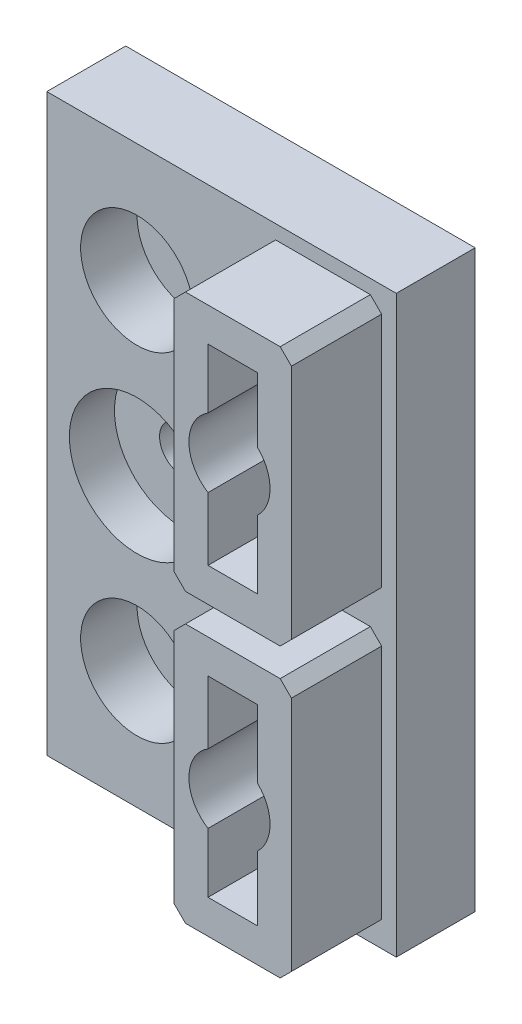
ISO-10303-21;
HEADER;
FILE_DESCRIPTION(('STEP AP214'),'2;1');
FILE_NAME('part.step','',(''),(''),'','','');
FILE_SCHEMA(('AUTOMOTIVE_DESIGN { 1 0 10303 214 1 1 1 1 }'));
ENDSEC;
DATA;
#1=APPLICATION_CONTEXT('core data for automotive mechanical design processes');
#2=APPLICATION_PROTOCOL_DEFINITION('international standard','automotive_design',2000,#1);
#3=PRODUCT_CONTEXT('',#1,'mechanical');
#4=PRODUCT('Part','Part','',(#3));
#5=PRODUCT_RELATED_PRODUCT_CATEGORY('part','',(#4));
#6=PRODUCT_DEFINITION_FORMATION('','',#4);
#7=PRODUCT_DEFINITION_CONTEXT('part definition',#1,'design');
#8=PRODUCT_DEFINITION('design','',#6,#7);
#9=PRODUCT_DEFINITION_SHAPE('','',#8);
#10=(LENGTH_UNIT() NAMED_UNIT(*) SI_UNIT(.MILLI.,.METRE.));
#11=(NAMED_UNIT(*) PLANE_ANGLE_UNIT() SI_UNIT($,.RADIAN.));
#12=(NAMED_UNIT(*) SI_UNIT($,.STERADIAN.) SOLID_ANGLE_UNIT());
#13=UNCERTAINTY_MEASURE_WITH_UNIT(LENGTH_MEASURE(1.E-05),#10,'distance_accuracy_value','');
#14=(GEOMETRIC_REPRESENTATION_CONTEXT(3) GLOBAL_UNCERTAINTY_ASSIGNED_CONTEXT((#13)) GLOBAL_UNIT_ASSIGNED_CONTEXT((#10,
#11,#12)) REPRESENTATION_CONTEXT('',''));
#15=CARTESIAN_POINT('',(0.,0.,0.));
#16=DIRECTION('',(0.,0.,1.));
#17=DIRECTION('',(1.,0.,0.));
#18=AXIS2_PLACEMENT_3D('',#15,#16,#17);
#19=CARTESIAN_POINT('',(0.,0.,5.));
#20=DIRECTION('',(0.,0.,1.));
#21=DIRECTION('',(1.,0.,0.));
#22=AXIS2_PLACEMENT_3D('',#19,#20,#21);
#23=PLANE('',#22);
#24=DIRECTION('',(-1.,0.,0.));
#25=VECTOR('',#24,1.);
#26=CARTESIAN_POINT('',(0.,-4.25000000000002,5.));
#27=LINE('',#26,#25);
#28=CARTESIAN_POINT('',(18.7,-4.25000000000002,5.));
#29=VERTEX_POINT('',#28);
#30=CARTESIAN_POINT('',(14.3000000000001,-4.25000000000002,5.));
#31=VERTEX_POINT('',#30);
#32=EDGE_CURVE('E335',#29,#31,#27,.T.);
#33=ORIENTED_EDGE('',*,*,#32,.T.);
#34=DIRECTION('',(0.,1.,0.));
#35=VECTOR('',#34,1.);
#36=CARTESIAN_POINT('',(14.3000000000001,0.,5.));
#37=LINE('',#36,#35);
#38=CARTESIAN_POINT('',(14.3000000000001,-9.84472001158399,5.));
#39=VERTEX_POINT('',#38);
#40=EDGE_CURVE('E334',#39,#31,#37,.T.);
#41=ORIENTED_EDGE('',*,*,#40,.F.);
#42=CARTESIAN_POINT('',(16.2040126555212,-12.9,5.));
#43=DIRECTION('',(0.,0.,1.));
#44=DIRECTION('',(1.,0.,0.));
#45=AXIS2_PLACEMENT_3D('',#42,#43,#44);
#46=CIRCLE('',#45,3.6);
#47=CARTESIAN_POINT('',(18.7,-10.3057665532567,5.));
#48=VERTEX_POINT('',#47);
#49=EDGE_CURVE('E522',#48,#39,#46,.T.);
#50=ORIENTED_EDGE('',*,*,#49,.F.);
#51=DIRECTION('',(0.,1.,0.));
#52=VECTOR('',#51,1.);
#53=CARTESIAN_POINT('',(18.7,0.,5.));
#54=LINE('',#53,#52);
#55=EDGE_CURVE('E330',#48,#29,#54,.T.);
#56=ORIENTED_EDGE('',*,*,#55,.T.);
#57=EDGE_LOOP('',(#33,#41,#50,#56));
#58=FACE_BOUND('',#57,.T.);
#59=ADVANCED_FACE('F39',(#58),#23,.T.);
#60=CARTESIAN_POINT('',(18.7,-21.2500000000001,5.));
#61=VERTEX_POINT('',#60);
#62=CARTESIAN_POINT('',(18.7,-15.4942334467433,5.));
#63=VERTEX_POINT('',#62);
#64=EDGE_CURVE('E277',#61,#63,#54,.T.);
#65=ORIENTED_EDGE('',*,*,#64,.T.);
#66=CARTESIAN_POINT('',(14.3000000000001,-15.955279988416,5.));
#67=VERTEX_POINT('',#66);
#68=EDGE_CURVE('E513',#67,#63,#46,.T.);
#69=ORIENTED_EDGE('',*,*,#68,.F.);
#70=CARTESIAN_POINT('',(14.3000000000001,-21.2500000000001,5.));
#71=VERTEX_POINT('',#70);
#72=EDGE_CURVE('E332',#71,#67,#37,.T.);
#73=ORIENTED_EDGE('',*,*,#72,.F.);
#74=DIRECTION('',(-1.,0.,0.));
#75=VECTOR('',#74,1.);
#76=CARTESIAN_POINT('',(0.,-21.2500000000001,5.));
#77=LINE('',#76,#75);
#78=EDGE_CURVE('E329',#61,#71,#77,.T.);
#79=ORIENTED_EDGE('',*,*,#78,.F.);
#80=EDGE_LOOP('',(#65,#69,#73,#79));
#81=FACE_BOUND('',#80,.T.);
#82=ADVANCED_FACE('F645',(#81),#23,.T.);
#83=CARTESIAN_POINT('',(16.2040126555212,12.9,5.));
#84=DIRECTION('',(0.,0.,1.));
#85=DIRECTION('',(1.,0.,0.));
#86=AXIS2_PLACEMENT_3D('',#83,#84,#85);
#87=CIRCLE('',#86,3.6);
#88=CARTESIAN_POINT('',(18.7000000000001,15.4942334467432,5.));
#89=VERTEX_POINT('',#88);
#90=CARTESIAN_POINT('',(14.3000000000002,15.955279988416,5.));
#91=VERTEX_POINT('',#90);
#92=EDGE_CURVE('E530',#89,#91,#87,.T.);
#93=ORIENTED_EDGE('',*,*,#92,.F.);
#94=DIRECTION('',(0.,1.,0.));
#95=VECTOR('',#94,1.);
#96=CARTESIAN_POINT('',(18.7000000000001,0.,5.));
#97=LINE('',#96,#95);
#98=CARTESIAN_POINT('',(18.7000000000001,21.25,5.));
#99=VERTEX_POINT('',#98);
#100=EDGE_CURVE('E395',#89,#99,#97,.T.);
#101=ORIENTED_EDGE('',*,*,#100,.T.);
#102=DIRECTION('',(-1.,0.,0.));
#103=VECTOR('',#102,1.);
#104=CARTESIAN_POINT('',(0.,21.25,5.));
#105=LINE('',#104,#103);
#106=CARTESIAN_POINT('',(14.3000000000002,21.25,5.));
#107=VERTEX_POINT('',#106);
#108=EDGE_CURVE('E557',#99,#107,#105,.T.);
#109=ORIENTED_EDGE('',*,*,#108,.T.);
#110=DIRECTION('',(0.,1.,0.));
#111=VECTOR('',#110,1.);
#112=CARTESIAN_POINT('',(14.3000000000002,0.,5.));
#113=LINE('',#112,#111);
#114=EDGE_CURVE('E560',#91,#107,#113,.T.);
#115=ORIENTED_EDGE('',*,*,#114,.F.);
#116=EDGE_LOOP('',(#93,#101,#109,#115));
#117=FACE_BOUND('',#116,.T.);
#118=ADVANCED_FACE('F648',(#117),#23,.T.);
#119=DIRECTION('',(-1.,0.,0.));
#120=VECTOR('',#119,1.);
#121=CARTESIAN_POINT('',(0.,4.24999999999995,5.));
#122=LINE('',#121,#120);
#123=CARTESIAN_POINT('',(18.7000000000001,4.24999999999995,5.));
#124=VERTEX_POINT('',#123);
#125=CARTESIAN_POINT('',(14.3000000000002,4.24999999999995,5.));
#126=VERTEX_POINT('',#125);
#127=EDGE_CURVE('E391',#124,#126,#122,.T.);
#128=ORIENTED_EDGE('',*,*,#127,.F.);
#129=CARTESIAN_POINT('',(18.7000000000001,10.3057665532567,5.));
#130=VERTEX_POINT('',#129);
#131=EDGE_CURVE('E280',#124,#130,#97,.T.);
#132=ORIENTED_EDGE('',*,*,#131,.T.);
#133=CARTESIAN_POINT('',(14.3000000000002,9.84472001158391,5.));
#134=VERTEX_POINT('',#133);
#135=EDGE_CURVE('E401',#134,#130,#87,.T.);
#136=ORIENTED_EDGE('',*,*,#135,.F.);
#137=EDGE_CURVE('E563',#126,#134,#113,.T.);
#138=ORIENTED_EDGE('',*,*,#137,.F.);
#139=EDGE_LOOP('',(#128,#132,#136,#138));
#140=FACE_BOUND('',#139,.T.);
#141=ADVANCED_FACE('F653',(#140),#23,.T.);
#142=DIRECTION('',(-1.,0.,0.));
#143=VECTOR('',#142,1.);
#144=CARTESIAN_POINT('',(0.,-24.2500000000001,5.));
#145=LINE('',#144,#143);
#146=CARTESIAN_POINT('',(20.7,-24.2500000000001,5.));
#147=VERTEX_POINT('',#146);
#148=CARTESIAN_POINT('',(12.3000000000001,-24.2500000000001,5.));
#149=VERTEX_POINT('',#148);
#150=EDGE_CURVE('E341',#147,#149,#145,.T.);
#151=ORIENTED_EDGE('',*,*,#150,.T.);
#152=DIRECTION('',(0.707106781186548,-0.707106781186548,0.));
#153=VECTOR('',#152,1.);
#154=CARTESIAN_POINT('',(12.3000000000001,-24.2500000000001,5.));
#155=LINE('',#154,#153);
#156=CARTESIAN_POINT('',(11.3000000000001,-23.2500000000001,5.));
#157=VERTEX_POINT('',#156);
#158=EDGE_CURVE('E592',#149,#157,#155,.F.);
#159=ORIENTED_EDGE('',*,*,#158,.T.);
#160=DIRECTION('',(0.,1.,0.));
#161=VECTOR('',#160,1.);
#162=CARTESIAN_POINT('',(11.3000000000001,0.,5.));
#163=LINE('',#162,#161);
#164=CARTESIAN_POINT('',(11.3000000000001,-2.25000000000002,5.));
#165=VERTEX_POINT('',#164);
#166=EDGE_CURVE('E338',#157,#165,#163,.T.);
#167=ORIENTED_EDGE('',*,*,#166,.T.);
#168=DIRECTION('',(0.70710678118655,0.707106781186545,0.));
#169=VECTOR('',#168,1.);
#170=CARTESIAN_POINT('',(11.3000000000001,-2.25000000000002,5.));
#171=LINE('',#170,#169);
#172=CARTESIAN_POINT('',(12.3000000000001,-1.25000000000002,5.));
#173=VERTEX_POINT('',#172);
#174=EDGE_CURVE('E594',#165,#173,#171,.T.);
#175=ORIENTED_EDGE('',*,*,#174,.T.);
#176=DIRECTION('',(-1.,0.,0.));
#177=VECTOR('',#176,1.);
#178=CARTESIAN_POINT('',(0.,-1.25000000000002,5.));
#179=LINE('',#178,#177);
#180=CARTESIAN_POINT('',(20.7,-1.25000000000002,5.));
#181=VERTEX_POINT('',#180);
#182=EDGE_CURVE('E297',#181,#173,#179,.T.);
#183=ORIENTED_EDGE('',*,*,#182,.F.);
#184=DIRECTION('',(-0.707106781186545,0.70710678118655,0.));
#185=VECTOR('',#184,1.);
#186=CARTESIAN_POINT('',(20.7,-1.25000000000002,5.));
#187=LINE('',#186,#185);
#188=CARTESIAN_POINT('',(21.7,-2.25000000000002,5.));
#189=VERTEX_POINT('',#188);
#190=EDGE_CURVE('E596',#181,#189,#187,.F.);
#191=ORIENTED_EDGE('',*,*,#190,.T.);
#192=DIRECTION('',(0.,1.,0.));
#193=VECTOR('',#192,1.);
#194=CARTESIAN_POINT('',(21.7,0.,5.));
#195=LINE('',#194,#193);
#196=CARTESIAN_POINT('',(21.7,-23.2500000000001,5.));
#197=VERTEX_POINT('',#196);
#198=EDGE_CURVE('E301',#197,#189,#195,.T.);
#199=ORIENTED_EDGE('',*,*,#198,.F.);
#200=DIRECTION('',(-0.70710678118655,-0.707106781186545,0.));
#201=VECTOR('',#200,1.);
#202=CARTESIAN_POINT('',(21.7,-23.2500000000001,5.));
#203=LINE('',#202,#201);
#204=EDGE_CURVE('E585',#197,#147,#203,.T.);
#205=ORIENTED_EDGE('',*,*,#204,.T.);
#206=EDGE_LOOP('',(#151,#159,#167,#175,#183,#191,#199,#205));
#207=FACE_BOUND('',#206,.T.);
#208=CARTESIAN_POINT('',(0.,0.,5.));
#209=DIRECTION('',(0.,0.,1.));
#210=DIRECTION('',(1.,0.,0.));
#211=AXIS2_PLACEMENT_3D('',#208,#209,#210);
#212=CIRCLE('',#211,6.);
#213=CARTESIAN_POINT('',(6.,0.,5.));
#214=VERTEX_POINT('',#213);
#215=EDGE_CURVE('E492',#214,#214,#212,.T.);
#216=ORIENTED_EDGE('',*,*,#215,.F.);
#217=EDGE_LOOP('',(#216));
#218=FACE_BOUND('',#217,.T.);
#219=CARTESIAN_POINT('',(0.,-15.,5.));
#220=DIRECTION('',(0.,0.,1.));
#221=DIRECTION('',(1.,0.,0.));
#222=AXIS2_PLACEMENT_3D('',#219,#220,#221);
#223=CIRCLE('',#222,5.);
#224=CARTESIAN_POINT('',(5.,-15.,5.));
#225=VERTEX_POINT('',#224);
#226=EDGE_CURVE('E503',#225,#225,#223,.T.);
#227=ORIENTED_EDGE('',*,*,#226,.F.);
#228=EDGE_LOOP('',(#227));
#229=FACE_BOUND('',#228,.T.);
#230=CARTESIAN_POINT('',(0.,15.,5.));
#231=DIRECTION('',(0.,0.,1.));
#232=DIRECTION('',(1.,0.,0.));
#233=AXIS2_PLACEMENT_3D('',#230,#231,#232);
#234=CIRCLE('',#233,5.);
#235=CARTESIAN_POINT('',(5.00000000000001,15.,5.));
#236=VERTEX_POINT('',#235);
#237=EDGE_CURVE('E506',#236,#236,#234,.T.);
#238=ORIENTED_EDGE('',*,*,#237,.F.);
#239=EDGE_LOOP('',(#238));
#240=FACE_BOUND('',#239,.T.);
#241=DIRECTION('',(0.,-1.,0.));
#242=VECTOR('',#241,1.);
#243=CARTESIAN_POINT('',(23.,0.,5.));
#244=LINE('',#243,#242);
#245=CARTESIAN_POINT('',(23.,25.5,5.));
#246=VERTEX_POINT('',#245);
#247=CARTESIAN_POINT('',(23.,-25.5,5.));
#248=VERTEX_POINT('',#247);
#249=EDGE_CURVE('E439',#246,#248,#244,.T.);
#250=ORIENTED_EDGE('',*,*,#249,.F.);
#251=DIRECTION('',(1.,0.,0.));
#252=VECTOR('',#251,1.);
#253=CARTESIAN_POINT('',(0.,25.5,5.));
#254=LINE('',#253,#252);
#255=CARTESIAN_POINT('',(-7.99999999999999,25.5,5.));
#256=VERTEX_POINT('',#255);
#257=EDGE_CURVE('E435',#256,#246,#254,.T.);
#258=ORIENTED_EDGE('',*,*,#257,.F.);
#259=DIRECTION('',(0.,-1.,0.));
#260=VECTOR('',#259,1.);
#261=CARTESIAN_POINT('',(-7.99999999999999,0.,5.));
#262=LINE('',#261,#260);
#263=CARTESIAN_POINT('',(-7.99999999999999,-25.5,5.));
#264=VERTEX_POINT('',#263);
#265=EDGE_CURVE('E510',#256,#264,#262,.T.);
#266=ORIENTED_EDGE('',*,*,#265,.T.);
#267=DIRECTION('',(1.,0.,0.));
#268=VECTOR('',#267,1.);
#269=CARTESIAN_POINT('',(0.,-25.5,5.));
#270=LINE('',#269,#268);
#271=EDGE_CURVE('E446',#264,#248,#270,.T.);
#272=ORIENTED_EDGE('',*,*,#271,.T.);
#273=EDGE_LOOP('',(#250,#258,#266,#272));
#274=FACE_BOUND('',#273,.T.);
#275=CARTESIAN_POINT('',(10.,0.,5.));
#276=DIRECTION('',(0.,0.,1.));
#277=DIRECTION('',(1.,0.,0.));
#278=AXIS2_PLACEMENT_3D('',#275,#276,#277);
#279=CIRCLE('',#278,1.);
#280=CARTESIAN_POINT('',(11.,0.,5.));
#281=VERTEX_POINT('',#280);
#282=EDGE_CURVE('E458',#281,#281,#279,.T.);
#283=ORIENTED_EDGE('',*,*,#282,.F.);
#284=EDGE_LOOP('',(#283));
#285=FACE_BOUND('',#284,.T.);
#286=DIRECTION('',(0.,1.,0.));
#287=VECTOR('',#286,1.);
#288=CARTESIAN_POINT('',(21.7000000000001,0.,5.));
#289=LINE('',#288,#287);
#290=CARTESIAN_POINT('',(21.7000000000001,2.24999999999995,5.));
#291=VERTEX_POINT('',#290);
#292=CARTESIAN_POINT('',(21.7000000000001,23.25,5.));
#293=VERTEX_POINT('',#292);
#294=EDGE_CURVE('E567',#291,#293,#289,.T.);
#295=ORIENTED_EDGE('',*,*,#294,.F.);
#296=DIRECTION('',(-0.707106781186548,-0.707106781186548,0.));
#297=VECTOR('',#296,1.);
#298=CARTESIAN_POINT('',(21.7000000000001,2.24999999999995,5.));
#299=LINE('',#298,#297);
#300=CARTESIAN_POINT('',(20.7000000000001,1.24999999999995,5.));
#301=VERTEX_POINT('',#300);
#302=EDGE_CURVE('E600',#291,#301,#299,.T.);
#303=ORIENTED_EDGE('',*,*,#302,.T.);
#304=DIRECTION('',(-1.,0.,0.));
#305=VECTOR('',#304,1.);
#306=CARTESIAN_POINT('',(0.,1.24999999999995,5.));
#307=LINE('',#306,#305);
#308=CARTESIAN_POINT('',(12.3000000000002,1.24999999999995,5.));
#309=VERTEX_POINT('',#308);
#310=EDGE_CURVE('E558',#301,#309,#307,.T.);
#311=ORIENTED_EDGE('',*,*,#310,.T.);
#312=DIRECTION('',(0.707106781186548,-0.707106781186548,0.));
#313=VECTOR('',#312,1.);
#314=CARTESIAN_POINT('',(12.3000000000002,1.24999999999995,5.));
#315=LINE('',#314,#313);
#316=CARTESIAN_POINT('',(11.3000000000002,2.24999999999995,5.));
#317=VERTEX_POINT('',#316);
#318=EDGE_CURVE('E598',#309,#317,#315,.F.);
#319=ORIENTED_EDGE('',*,*,#318,.T.);
#320=DIRECTION('',(0.,1.,0.));
#321=VECTOR('',#320,1.);
#322=CARTESIAN_POINT('',(11.3000000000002,0.,5.));
#323=LINE('',#322,#321);
#324=CARTESIAN_POINT('',(11.3000000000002,23.25,5.));
#325=VERTEX_POINT('',#324);
#326=EDGE_CURVE('E556',#317,#325,#323,.T.);
#327=ORIENTED_EDGE('',*,*,#326,.T.);
#328=DIRECTION('',(0.707106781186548,0.707106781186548,0.));
#329=VECTOR('',#328,1.);
#330=CARTESIAN_POINT('',(11.3000000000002,23.25,5.));
#331=LINE('',#330,#329);
#332=CARTESIAN_POINT('',(12.3000000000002,24.25,5.));
#333=VERTEX_POINT('',#332);
#334=EDGE_CURVE('E12',#325,#333,#331,.T.);
#335=ORIENTED_EDGE('',*,*,#334,.T.);
#336=DIRECTION('',(-1.,0.,0.));
#337=VECTOR('',#336,1.);
#338=CARTESIAN_POINT('',(0.,24.25,5.));
#339=LINE('',#338,#337);
#340=CARTESIAN_POINT('',(20.7000000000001,24.25,5.));
#341=VERTEX_POINT('',#340);
#342=EDGE_CURVE('E364',#341,#333,#339,.T.);
#343=ORIENTED_EDGE('',*,*,#342,.F.);
#344=DIRECTION('',(-0.707106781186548,0.707106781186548,0.));
#345=VECTOR('',#344,1.);
#346=CARTESIAN_POINT('',(20.7000000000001,24.25,5.));
#347=LINE('',#346,#345);
#348=EDGE_CURVE('E47',#341,#293,#347,.F.);
#349=ORIENTED_EDGE('',*,*,#348,.T.);
#350=EDGE_LOOP('',(#295,#303,#311,#319,#327,#335,#343,#349));
#351=FACE_BOUND('',#350,.T.);
#352=ADVANCED_FACE('F601',(#207,#218,#229,#240,#274,#285,#351),#23,.T.);
#353=CARTESIAN_POINT('',(16.2040126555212,-12.9,-12.1823376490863));
#354=DIRECTION('',(0.,0.,1.));
#355=DIRECTION('',(1.,0.,0.));
#356=AXIS2_PLACEMENT_3D('',#353,#354,#355);
#357=CYLINDRICAL_SURFACE('',#356,3.6);
#358=CARTESIAN_POINT('',(16.2040126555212,-12.9,1.5));
#359=DIRECTION('',(0.,0.,-1.));
#360=DIRECTION('',(-1.,0.,0.));
#361=AXIS2_PLACEMENT_3D('',#358,#359,#360);
#362=CIRCLE('',#361,3.6);
#363=CARTESIAN_POINT('',(12.6040126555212,-12.9,1.5));
#364=VERTEX_POINT('',#363);
#365=EDGE_CURVE('E477',#364,#364,#362,.F.);
#366=ORIENTED_EDGE('',*,*,#365,.F.);
#367=EDGE_LOOP('',(#366));
#368=FACE_BOUND('',#367,.T.);
#369=ORIENTED_EDGE('',*,*,#49,.T.);
#370=DIRECTION('',(0.,0.,-1.));
#371=VECTOR('',#370,1.);
#372=CARTESIAN_POINT('',(14.3000000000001,-9.84472001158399,13.));
#373=LINE('',#372,#371);
#374=CARTESIAN_POINT('',(14.3000000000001,-9.84472001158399,13.));
#375=VERTEX_POINT('',#374);
#376=EDGE_CURVE('E354',#375,#39,#373,.T.);
#377=ORIENTED_EDGE('',*,*,#376,.F.);
#378=CARTESIAN_POINT('',(16.2040126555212,-12.9,13.));
#379=DIRECTION('',(0.,0.,1.));
#380=DIRECTION('',(1.,0.,0.));
#381=AXIS2_PLACEMENT_3D('',#378,#379,#380);
#382=CIRCLE('',#381,3.6);
#383=CARTESIAN_POINT('',(14.3000000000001,-15.955279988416,13.));
#384=VERTEX_POINT('',#383);
#385=EDGE_CURVE('E308',#384,#375,#382,.F.);
#386=ORIENTED_EDGE('',*,*,#385,.F.);
#387=DIRECTION('',(0.,0.,-1.));
#388=VECTOR('',#387,1.);
#389=CARTESIAN_POINT('',(14.3000000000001,-15.955279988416,13.));
#390=LINE('',#389,#388);
#391=EDGE_CURVE('E356',#384,#67,#390,.T.);
#392=ORIENTED_EDGE('',*,*,#391,.T.);
#393=ORIENTED_EDGE('',*,*,#68,.T.);
#394=DIRECTION('',(0.,0.,-1.));
#395=VECTOR('',#394,1.);
#396=CARTESIAN_POINT('',(18.7,-15.4942334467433,13.));
#397=LINE('',#396,#395);
#398=CARTESIAN_POINT('',(18.7,-15.4942334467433,13.));
#399=VERTEX_POINT('',#398);
#400=EDGE_CURVE('E327',#399,#63,#397,.T.);
#401=ORIENTED_EDGE('',*,*,#400,.F.);
#402=CARTESIAN_POINT('',(18.7,-10.3057665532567,13.));
#403=VERTEX_POINT('',#402);
#404=EDGE_CURVE('E295',#403,#399,#382,.F.);
#405=ORIENTED_EDGE('',*,*,#404,.F.);
#406=DIRECTION('',(0.,0.,-1.));
#407=VECTOR('',#406,1.);
#408=CARTESIAN_POINT('',(18.7,-10.3057665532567,13.));
#409=LINE('',#408,#407);
#410=EDGE_CURVE('E347',#403,#48,#409,.T.);
#411=ORIENTED_EDGE('',*,*,#410,.T.);
#412=EDGE_LOOP('',(#369,#377,#386,#392,#393,#401,#405,#411));
#413=FACE_BOUND('',#412,.T.);
#414=ADVANCED_FACE('F661',(#368,#413),#357,.F.);
#415=CARTESIAN_POINT('',(16.2040126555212,12.9,-12.1823376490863));
#416=DIRECTION('',(0.,0.,1.));
#417=DIRECTION('',(1.,0.,0.));
#418=AXIS2_PLACEMENT_3D('',#415,#416,#417);
#419=CYLINDRICAL_SURFACE('',#418,3.6);
#420=CARTESIAN_POINT('',(16.2040126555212,12.9,1.5));
#421=DIRECTION('',(0.,0.,-1.));
#422=DIRECTION('',(-1.,0.,0.));
#423=AXIS2_PLACEMENT_3D('',#420,#421,#422);
#424=CIRCLE('',#423,3.6);
#425=CARTESIAN_POINT('',(12.6040126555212,12.9,1.5));
#426=VERTEX_POINT('',#425);
#427=EDGE_CURVE('E474',#426,#426,#424,.F.);
#428=ORIENTED_EDGE('',*,*,#427,.F.);
#429=EDGE_LOOP('',(#428));
#430=FACE_BOUND('',#429,.T.);
#431=ORIENTED_EDGE('',*,*,#92,.T.);
#432=DIRECTION('',(0.,0.,-1.));
#433=VECTOR('',#432,1.);
#434=CARTESIAN_POINT('',(14.3000000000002,15.955279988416,13.));
#435=LINE('',#434,#433);
#436=CARTESIAN_POINT('',(14.3000000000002,15.955279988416,13.));
#437=VERTEX_POINT('',#436);
#438=EDGE_CURVE('E422',#437,#91,#435,.T.);
#439=ORIENTED_EDGE('',*,*,#438,.F.);
#440=CARTESIAN_POINT('',(16.2040126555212,12.9,13.));
#441=DIRECTION('',(0.,0.,1.));
#442=DIRECTION('',(1.,0.,0.));
#443=AXIS2_PLACEMENT_3D('',#440,#441,#442);
#444=CIRCLE('',#443,3.6);
#445=CARTESIAN_POINT('',(14.3000000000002,9.84472001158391,13.));
#446=VERTEX_POINT('',#445);
#447=EDGE_CURVE('E369',#446,#437,#444,.F.);
#448=ORIENTED_EDGE('',*,*,#447,.F.);
#449=DIRECTION('',(0.,0.,-1.));
#450=VECTOR('',#449,1.);
#451=CARTESIAN_POINT('',(14.3000000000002,9.84472001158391,13.));
#452=LINE('',#451,#450);
#453=EDGE_CURVE('E431',#446,#134,#452,.T.);
#454=ORIENTED_EDGE('',*,*,#453,.T.);
#455=ORIENTED_EDGE('',*,*,#135,.T.);
#456=DIRECTION('',(0.,0.,-1.));
#457=VECTOR('',#456,1.);
#458=CARTESIAN_POINT('',(18.7000000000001,10.3057665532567,13.));
#459=LINE('',#458,#457);
#460=CARTESIAN_POINT('',(18.7000000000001,10.3057665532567,13.));
#461=VERTEX_POINT('',#460);
#462=EDGE_CURVE('E388',#461,#130,#459,.T.);
#463=ORIENTED_EDGE('',*,*,#462,.F.);
#464=CARTESIAN_POINT('',(18.7000000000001,15.4942334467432,13.));
#465=VERTEX_POINT('',#464);
#466=EDGE_CURVE('E372',#465,#461,#444,.F.);
#467=ORIENTED_EDGE('',*,*,#466,.F.);
#468=DIRECTION('',(0.,0.,-1.));
#469=VECTOR('',#468,1.);
#470=CARTESIAN_POINT('',(18.7000000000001,15.4942334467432,13.));
#471=LINE('',#470,#469);
#472=EDGE_CURVE('E405',#465,#89,#471,.T.);
#473=ORIENTED_EDGE('',*,*,#472,.T.);
#474=EDGE_LOOP('',(#431,#439,#448,#454,#455,#463,#467,#473));
#475=FACE_BOUND('',#474,.T.);
#476=ADVANCED_FACE('F538',(#430,#475),#419,.F.);
#477=CARTESIAN_POINT('',(-7.99999999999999,0.,5.));
#478=DIRECTION('',(1.,0.,0.));
#479=DIRECTION('',(0.,0.,-1.));
#480=AXIS2_PLACEMENT_3D('',#477,#478,#479);
#481=PLANE('',#480);
#482=DIRECTION('',(0.,0.,1.));
#483=VECTOR('',#482,1.);
#484=CARTESIAN_POINT('',(-7.99999999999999,-25.5,-5.));
#485=LINE('',#484,#483);
#486=CARTESIAN_POINT('',(-7.99999999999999,-25.5,-2.));
#487=VERTEX_POINT('',#486);
#488=EDGE_CURVE('E456',#487,#264,#485,.T.);
#489=ORIENTED_EDGE('',*,*,#488,.T.);
#490=ORIENTED_EDGE('',*,*,#265,.F.);
#491=DIRECTION('',(0.,0.,1.));
#492=VECTOR('',#491,1.);
#493=CARTESIAN_POINT('',(-7.99999999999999,25.5,-61.6824932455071));
#494=LINE('',#493,#492);
#495=CARTESIAN_POINT('',(-7.99999999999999,25.5,-2.));
#496=VERTEX_POINT('',#495);
#497=EDGE_CURVE('E438',#496,#256,#494,.T.);
#498=ORIENTED_EDGE('',*,*,#497,.F.);
#499=DIRECTION('',(0.,1.,0.));
#500=VECTOR('',#499,1.);
#501=CARTESIAN_POINT('',(-7.99999999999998,25.8,-2.));
#502=LINE('',#501,#500);
#503=EDGE_CURVE('E499',#487,#496,#502,.T.);
#504=ORIENTED_EDGE('',*,*,#503,.F.);
#505=EDGE_LOOP('',(#489,#490,#498,#504));
#506=FACE_BOUND('',#505,.T.);
#507=ADVANCED_FACE('F705',(#506),#481,.F.);
#508=CARTESIAN_POINT('',(0.,0.,-2.));
#509=DIRECTION('',(0.,0.,-1.));
#510=DIRECTION('',(-1.,0.,0.));
#511=AXIS2_PLACEMENT_3D('',#508,#509,#510);
#512=PLANE('',#511);
#513=DIRECTION('',(-1.,0.,0.));
#514=VECTOR('',#513,1.);
#515=CARTESIAN_POINT('',(0.,-25.5,-2.));
#516=LINE('',#515,#514);
#517=CARTESIAN_POINT('',(23.,-25.5,-2.));
#518=VERTEX_POINT('',#517);
#519=EDGE_CURVE('E527',#518,#487,#516,.T.);
#520=ORIENTED_EDGE('',*,*,#519,.T.);
#521=ORIENTED_EDGE('',*,*,#503,.T.);
#522=DIRECTION('',(1.,0.,0.));
#523=VECTOR('',#522,1.);
#524=CARTESIAN_POINT('',(0.,25.5,-2.));
#525=LINE('',#524,#523);
#526=CARTESIAN_POINT('',(23.,25.5,-2.));
#527=VERTEX_POINT('',#526);
#528=EDGE_CURVE('E443',#496,#527,#525,.T.);
#529=ORIENTED_EDGE('',*,*,#528,.T.);
#530=DIRECTION('',(0.,-1.,0.));
#531=VECTOR('',#530,1.);
#532=CARTESIAN_POINT('',(23.,0.,-2.));
#533=LINE('',#532,#531);
#534=EDGE_CURVE('E442',#527,#518,#533,.T.);
#535=ORIENTED_EDGE('',*,*,#534,.T.);
#536=EDGE_LOOP('',(#520,#521,#529,#535));
#537=FACE_BOUND('',#536,.T.);
#538=CARTESIAN_POINT('',(10.,0.,-2.));
#539=DIRECTION('',(0.,0.,-1.));
#540=DIRECTION('',(-1.,0.,0.));
#541=AXIS2_PLACEMENT_3D('',#538,#539,#540);
#542=CIRCLE('',#541,1.);
#543=CARTESIAN_POINT('',(9.,0.,-2.));
#544=VERTEX_POINT('',#543);
#545=EDGE_CURVE('E461',#544,#544,#542,.T.);
#546=ORIENTED_EDGE('',*,*,#545,.F.);
#547=EDGE_LOOP('',(#546));
#548=FACE_BOUND('',#547,.T.);
#549=CARTESIAN_POINT('',(16.2040126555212,-12.9,-2.));
#550=DIRECTION('',(0.,0.,-1.));
#551=DIRECTION('',(-1.,0.,0.));
#552=AXIS2_PLACEMENT_3D('',#549,#550,#551);
#553=CIRCLE('',#552,1.);
#554=CARTESIAN_POINT('',(15.2040126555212,-12.9,-2.));
#555=VERTEX_POINT('',#554);
#556=EDGE_CURVE('E465',#555,#555,#553,.T.);
#557=ORIENTED_EDGE('',*,*,#556,.F.);
#558=EDGE_LOOP('',(#557));
#559=FACE_BOUND('',#558,.T.);
#560=CARTESIAN_POINT('',(16.2040126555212,12.9,-2.));
#561=DIRECTION('',(0.,0.,-1.));
#562=DIRECTION('',(-1.,0.,0.));
#563=AXIS2_PLACEMENT_3D('',#560,#561,#562);
#564=CIRCLE('',#563,0.999999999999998);
#565=CARTESIAN_POINT('',(15.2040126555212,12.9,-2.));
#566=VERTEX_POINT('',#565);
#567=EDGE_CURVE('E471',#566,#566,#564,.T.);
#568=ORIENTED_EDGE('',*,*,#567,.F.);
#569=EDGE_LOOP('',(#568));
#570=FACE_BOUND('',#569,.T.);
#571=CARTESIAN_POINT('',(0.,-15.,-2.));
#572=DIRECTION('',(0.,0.,-1.));
#573=DIRECTION('',(-1.,0.,0.));
#574=AXIS2_PLACEMENT_3D('',#571,#572,#573);
#575=CIRCLE('',#574,1.);
#576=CARTESIAN_POINT('',(-1.,-15.,-2.));
#577=VERTEX_POINT('',#576);
#578=EDGE_CURVE('E483',#577,#577,#575,.T.);
#579=ORIENTED_EDGE('',*,*,#578,.F.);
#580=EDGE_LOOP('',(#579));
#581=FACE_BOUND('',#580,.T.);
#582=CARTESIAN_POINT('',(0.,15.,-2.));
#583=DIRECTION('',(0.,0.,-1.));
#584=DIRECTION('',(-1.,0.,0.));
#585=AXIS2_PLACEMENT_3D('',#582,#583,#584);
#586=CIRCLE('',#585,0.999999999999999);
#587=CARTESIAN_POINT('',(-0.999999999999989,15.,-2.));
#588=VERTEX_POINT('',#587);
#589=EDGE_CURVE('E489',#588,#588,#586,.T.);
#590=ORIENTED_EDGE('',*,*,#589,.F.);
#591=EDGE_LOOP('',(#590));
#592=FACE_BOUND('',#591,.T.);
#593=CARTESIAN_POINT('',(0.,0.,-2.));
#594=DIRECTION('',(0.,0.,-1.));
#595=DIRECTION('',(-1.,0.,0.));
#596=AXIS2_PLACEMENT_3D('',#593,#594,#595);
#597=CIRCLE('',#596,2.);
#598=CARTESIAN_POINT('',(-2.,0.,-2.));
#599=VERTEX_POINT('',#598);
#600=EDGE_CURVE('E502',#599,#599,#597,.T.);
#601=ORIENTED_EDGE('',*,*,#600,.F.);
#602=EDGE_LOOP('',(#601));
#603=FACE_BOUND('',#602,.T.);
#604=ADVANCED_FACE('F735',(#537,#548,#559,#570,#581,#592,#603),#512,.T.);
#605=CARTESIAN_POINT('',(0.,0.,-5.));
#606=DIRECTION('',(0.,0.,1.));
#607=DIRECTION('',(1.,0.,0.));
#608=AXIS2_PLACEMENT_3D('',#605,#606,#607);
#609=CYLINDRICAL_SURFACE('',#608,2.);
#610=ORIENTED_EDGE('',*,*,#600,.T.);
#611=EDGE_LOOP('',(#610));
#612=FACE_BOUND('',#611,.T.);
#613=CARTESIAN_POINT('',(0.,0.,1.));
#614=DIRECTION('',(0.,0.,1.));
#615=DIRECTION('',(1.,0.,0.));
#616=AXIS2_PLACEMENT_3D('',#613,#614,#615);
#617=CIRCLE('',#616,2.);
#618=CARTESIAN_POINT('',(2.,0.,1.));
#619=VERTEX_POINT('',#618);
#620=EDGE_CURVE('E496',#619,#619,#617,.F.);
#621=ORIENTED_EDGE('',*,*,#620,.F.);
#622=EDGE_LOOP('',(#621));
#623=FACE_BOUND('',#622,.T.);
#624=ADVANCED_FACE('F731',(#612,#623),#609,.F.);
#625=CARTESIAN_POINT('',(0.,15.,5.));
#626=DIRECTION('',(0.,0.,-1.));
#627=DIRECTION('',(-1.,0.,0.));
#628=AXIS2_PLACEMENT_3D('',#625,#626,#627);
#629=CYLINDRICAL_SURFACE('',#628,5.);
#630=ORIENTED_EDGE('',*,*,#237,.T.);
#631=EDGE_LOOP('',(#630));
#632=FACE_BOUND('',#631,.T.);
#633=CARTESIAN_POINT('',(0.,15.,0.));
#634=DIRECTION('',(0.,0.,1.));
#635=DIRECTION('',(1.,0.,0.));
#636=AXIS2_PLACEMENT_3D('',#633,#634,#635);
#637=CIRCLE('',#636,5.);
#638=CARTESIAN_POINT('',(5.00000000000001,15.,0.));
#639=VERTEX_POINT('',#638);
#640=EDGE_CURVE('E507',#639,#639,#637,.T.);
#641=ORIENTED_EDGE('',*,*,#640,.F.);
#642=EDGE_LOOP('',(#641));
#643=FACE_BOUND('',#642,.T.);
#644=ADVANCED_FACE('F734',(#632,#643),#629,.F.);
#645=CARTESIAN_POINT('',(0.,-15.,5.));
#646=DIRECTION('',(0.,0.,-1.));
#647=DIRECTION('',(-1.,0.,0.));
#648=AXIS2_PLACEMENT_3D('',#645,#646,#647);
#649=CYLINDRICAL_SURFACE('',#648,5.);
#650=ORIENTED_EDGE('',*,*,#226,.T.);
#651=EDGE_LOOP('',(#650));
#652=FACE_BOUND('',#651,.T.);
#653=CARTESIAN_POINT('',(0.,-15.,0.));
#654=DIRECTION('',(0.,0.,1.));
#655=DIRECTION('',(1.,0.,0.));
#656=AXIS2_PLACEMENT_3D('',#653,#654,#655);
#657=CIRCLE('',#656,5.);
#658=CARTESIAN_POINT('',(5.,-15.,0.));
#659=VERTEX_POINT('',#658);
#660=EDGE_CURVE('E501',#659,#659,#657,.T.);
#661=ORIENTED_EDGE('',*,*,#660,.F.);
#662=EDGE_LOOP('',(#661));
#663=FACE_BOUND('',#662,.T.);
#664=ADVANCED_FACE('F741',(#652,#663),#649,.F.);
#665=CARTESIAN_POINT('',(0.,0.,0.));
#666=DIRECTION('',(0.,0.,-1.));
#667=DIRECTION('',(-1.,0.,0.));
#668=AXIS2_PLACEMENT_3D('',#665,#666,#667);
#669=PLANE('',#668);
#670=CARTESIAN_POINT('',(0.,-15.,0.));
#671=DIRECTION('',(0.,0.,1.));
#672=DIRECTION('',(1.,0.,0.));
#673=AXIS2_PLACEMENT_3D('',#670,#671,#672);
#674=CIRCLE('',#673,1.);
#675=CARTESIAN_POINT('',(1.,-15.,0.));
#676=VERTEX_POINT('',#675);
#677=EDGE_CURVE('E480',#676,#676,#674,.T.);
#678=ORIENTED_EDGE('',*,*,#677,.F.);
#679=EDGE_LOOP('',(#678));
#680=FACE_BOUND('',#679,.T.);
#681=ORIENTED_EDGE('',*,*,#660,.T.);
#682=EDGE_LOOP('',(#681));
#683=FACE_BOUND('',#682,.T.);
#684=ADVANCED_FACE('F739',(#680,#683),#669,.F.);
#685=CARTESIAN_POINT('',(0.,15.,0.));
#686=DIRECTION('',(0.,0.,1.));
#687=DIRECTION('',(1.,0.,0.));
#688=AXIS2_PLACEMENT_3D('',#685,#686,#687);
#689=CIRCLE('',#688,0.999999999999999);
#690=CARTESIAN_POINT('',(1.00000000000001,15.,0.));
#691=VERTEX_POINT('',#690);
#692=EDGE_CURVE('E486',#691,#691,#689,.T.);
#693=ORIENTED_EDGE('',*,*,#692,.F.);
#694=EDGE_LOOP('',(#693));
#695=FACE_BOUND('',#694,.T.);
#696=ORIENTED_EDGE('',*,*,#640,.T.);
#697=EDGE_LOOP('',(#696));
#698=FACE_BOUND('',#697,.T.);
#699=ADVANCED_FACE('F726',(#695,#698),#669,.F.);
#700=CARTESIAN_POINT('',(0.,0.,1.));
#701=DIRECTION('',(0.,0.,1.));
#702=DIRECTION('',(1.,0.,0.));
#703=AXIS2_PLACEMENT_3D('',#700,#701,#702);
#704=PLANE('',#703);
#705=CARTESIAN_POINT('',(0.,0.,1.));
#706=DIRECTION('',(0.,0.,1.));
#707=DIRECTION('',(1.,0.,0.));
#708=AXIS2_PLACEMENT_3D('',#705,#706,#707);
#709=CIRCLE('',#708,6.);
#710=CARTESIAN_POINT('',(6.,0.,1.));
#711=VERTEX_POINT('',#710);
#712=EDGE_CURVE('E493',#711,#711,#709,.T.);
#713=ORIENTED_EDGE('',*,*,#712,.T.);
#714=EDGE_LOOP('',(#713));
#715=FACE_BOUND('',#714,.T.);
#716=ORIENTED_EDGE('',*,*,#620,.T.);
#717=EDGE_LOOP('',(#716));
#718=FACE_BOUND('',#717,.T.);
#719=ADVANCED_FACE('F723',(#715,#718),#704,.T.);
#720=CARTESIAN_POINT('',(0.,0.,1.));
#721=DIRECTION('',(0.,0.,1.));
#722=DIRECTION('',(1.,0.,0.));
#723=AXIS2_PLACEMENT_3D('',#720,#721,#722);
#724=CYLINDRICAL_SURFACE('',#723,6.);
#725=ORIENTED_EDGE('',*,*,#712,.F.);
#726=EDGE_LOOP('',(#725));
#727=FACE_BOUND('',#726,.T.);
#728=ORIENTED_EDGE('',*,*,#215,.T.);
#729=EDGE_LOOP('',(#728));
#730=FACE_BOUND('',#729,.T.);
#731=ADVANCED_FACE('F721',(#727,#730),#724,.F.);
#732=CARTESIAN_POINT('',(0.,15.,-10.));
#733=DIRECTION('',(0.,0.,1.));
#734=DIRECTION('',(1.,0.,0.));
#735=AXIS2_PLACEMENT_3D('',#732,#733,#734);
#736=CYLINDRICAL_SURFACE('',#735,0.999999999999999);
#737=ORIENTED_EDGE('',*,*,#589,.T.);
#738=EDGE_LOOP('',(#737));
#739=FACE_BOUND('',#738,.T.);
#740=ORIENTED_EDGE('',*,*,#692,.T.);
#741=EDGE_LOOP('',(#740));
#742=FACE_BOUND('',#741,.T.);
#743=ADVANCED_FACE('F717',(#739,#742),#736,.F.);
#744=CARTESIAN_POINT('',(0.,-15.,-10.));
#745=DIRECTION('',(0.,0.,1.));
#746=DIRECTION('',(1.,0.,0.));
#747=AXIS2_PLACEMENT_3D('',#744,#745,#746);
#748=CYLINDRICAL_SURFACE('',#747,1.);
#749=ORIENTED_EDGE('',*,*,#578,.T.);
#750=EDGE_LOOP('',(#749));
#751=FACE_BOUND('',#750,.T.);
#752=ORIENTED_EDGE('',*,*,#677,.T.);
#753=EDGE_LOOP('',(#752));
#754=FACE_BOUND('',#753,.T.);
#755=ADVANCED_FACE('F713',(#751,#754),#748,.F.);
#756=CARTESIAN_POINT('',(0.,0.,1.5));
#757=DIRECTION('',(0.,0.,-1.));
#758=DIRECTION('',(-1.,0.,0.));
#759=AXIS2_PLACEMENT_3D('',#756,#757,#758);
#760=PLANE('',#759);
#761=CARTESIAN_POINT('',(16.2040126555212,-12.9,1.5));
#762=DIRECTION('',(0.,0.,1.));
#763=DIRECTION('',(1.,0.,0.));
#764=AXIS2_PLACEMENT_3D('',#761,#762,#763);
#765=CIRCLE('',#764,1.);
#766=CARTESIAN_POINT('',(17.2040126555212,-12.9,1.5));
#767=VERTEX_POINT('',#766);
#768=EDGE_CURVE('E462',#767,#767,#765,.T.);
#769=ORIENTED_EDGE('',*,*,#768,.F.);
#770=EDGE_LOOP('',(#769));
#771=FACE_BOUND('',#770,.T.);
#772=ORIENTED_EDGE('',*,*,#365,.T.);
#773=EDGE_LOOP('',(#772));
#774=FACE_BOUND('',#773,.T.);
#775=ADVANCED_FACE('F708',(#771,#774),#760,.F.);
#776=CARTESIAN_POINT('',(0.,0.,1.5));
#777=DIRECTION('',(0.,0.,-1.));
#778=DIRECTION('',(-1.,0.,0.));
#779=AXIS2_PLACEMENT_3D('',#776,#777,#778);
#780=PLANE('',#779);
#781=CARTESIAN_POINT('',(16.2040126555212,12.9,1.5));
#782=DIRECTION('',(0.,0.,1.));
#783=DIRECTION('',(1.,0.,0.));
#784=AXIS2_PLACEMENT_3D('',#781,#782,#783);
#785=CIRCLE('',#784,0.999999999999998);
#786=CARTESIAN_POINT('',(17.2040126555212,12.9,1.5));
#787=VERTEX_POINT('',#786);
#788=EDGE_CURVE('E468',#787,#787,#785,.T.);
#789=ORIENTED_EDGE('',*,*,#788,.F.);
#790=EDGE_LOOP('',(#789));
#791=FACE_BOUND('',#790,.T.);
#792=ORIENTED_EDGE('',*,*,#427,.T.);
#793=EDGE_LOOP('',(#792));
#794=FACE_BOUND('',#793,.T.);
#795=ADVANCED_FACE('F701',(#791,#794),#780,.F.);
#796=CARTESIAN_POINT('',(16.2040126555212,12.9,-11.));
#797=DIRECTION('',(0.,0.,1.));
#798=DIRECTION('',(1.,0.,0.));
#799=AXIS2_PLACEMENT_3D('',#796,#797,#798);
#800=CYLINDRICAL_SURFACE('',#799,0.999999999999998);
#801=ORIENTED_EDGE('',*,*,#567,.T.);
#802=EDGE_LOOP('',(#801));
#803=FACE_BOUND('',#802,.T.);
#804=ORIENTED_EDGE('',*,*,#788,.T.);
#805=EDGE_LOOP('',(#804));
#806=FACE_BOUND('',#805,.T.);
#807=ADVANCED_FACE('F694',(#803,#806),#800,.F.);
#808=CARTESIAN_POINT('',(16.2040126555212,-12.9,-11.));
#809=DIRECTION('',(0.,0.,1.));
#810=DIRECTION('',(1.,0.,0.));
#811=AXIS2_PLACEMENT_3D('',#808,#809,#810);
#812=CYLINDRICAL_SURFACE('',#811,1.);
#813=ORIENTED_EDGE('',*,*,#556,.T.);
#814=EDGE_LOOP('',(#813));
#815=FACE_BOUND('',#814,.T.);
#816=ORIENTED_EDGE('',*,*,#768,.T.);
#817=EDGE_LOOP('',(#816));
#818=FACE_BOUND('',#817,.T.);
#819=ADVANCED_FACE('F684',(#815,#818),#812,.F.);
#820=CARTESIAN_POINT('',(10.,0.,-6.));
#821=DIRECTION('',(0.,0.,1.));
#822=DIRECTION('',(1.,0.,0.));
#823=AXIS2_PLACEMENT_3D('',#820,#821,#822);
#824=CYLINDRICAL_SURFACE('',#823,1.);
#825=ORIENTED_EDGE('',*,*,#545,.T.);
#826=EDGE_LOOP('',(#825));
#827=FACE_BOUND('',#826,.T.);
#828=ORIENTED_EDGE('',*,*,#282,.T.);
#829=EDGE_LOOP('',(#828));
#830=FACE_BOUND('',#829,.T.);
#831=ADVANCED_FACE('F681',(#827,#830),#824,.F.);
#832=CARTESIAN_POINT('',(0.,-25.5,-5.));
#833=DIRECTION('',(0.,-1.,0.));
#834=DIRECTION('',(0.,0.,-1.));
#835=AXIS2_PLACEMENT_3D('',#832,#833,#834);
#836=PLANE('',#835);
#837=ORIENTED_EDGE('',*,*,#519,.F.);
#838=DIRECTION('',(0.,0.,1.));
#839=VECTOR('',#838,1.);
#840=CARTESIAN_POINT('',(23.,-25.5,-61.6824932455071));
#841=LINE('',#840,#839);
#842=EDGE_CURVE('E434',#518,#248,#841,.T.);
#843=ORIENTED_EDGE('',*,*,#842,.T.);
#844=ORIENTED_EDGE('',*,*,#271,.F.);
#845=ORIENTED_EDGE('',*,*,#488,.F.);
#846=EDGE_LOOP('',(#837,#843,#844,#845));
#847=FACE_BOUND('',#846,.T.);
#848=ADVANCED_FACE('F683',(#847),#836,.T.);
#849=CARTESIAN_POINT('',(0.,25.5,-61.6824932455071));
#850=DIRECTION('',(0.,-1.,0.));
#851=DIRECTION('',(0.,0.,-1.));
#852=AXIS2_PLACEMENT_3D('',#849,#850,#851);
#853=PLANE('',#852);
#854=ORIENTED_EDGE('',*,*,#528,.F.);
#855=ORIENTED_EDGE('',*,*,#497,.T.);
#856=ORIENTED_EDGE('',*,*,#257,.T.);
#857=DIRECTION('',(0.,0.,1.));
#858=VECTOR('',#857,1.);
#859=CARTESIAN_POINT('',(23.,25.5,-61.6824932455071));
#860=LINE('',#859,#858);
#861=EDGE_CURVE('E437',#527,#246,#860,.T.);
#862=ORIENTED_EDGE('',*,*,#861,.F.);
#863=EDGE_LOOP('',(#854,#855,#856,#862));
#864=FACE_BOUND('',#863,.T.);
#865=ADVANCED_FACE('F691',(#864),#853,.F.);
#866=CARTESIAN_POINT('',(23.,0.,-61.6824932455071));
#867=DIRECTION('',(-1.,0.,0.));
#868=DIRECTION('',(0.,0.,1.));
#869=AXIS2_PLACEMENT_3D('',#866,#867,#868);
#870=PLANE('',#869);
#871=ORIENTED_EDGE('',*,*,#534,.F.);
#872=ORIENTED_EDGE('',*,*,#861,.T.);
#873=ORIENTED_EDGE('',*,*,#249,.T.);
#874=ORIENTED_EDGE('',*,*,#842,.F.);
#875=EDGE_LOOP('',(#871,#872,#873,#874));
#876=FACE_BOUND('',#875,.T.);
#877=ADVANCED_FACE('F787',(#876),#870,.F.);
#878=CARTESIAN_POINT('',(11.3000000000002,0.,13.));
#879=DIRECTION('',(-1.,0.,0.));
#880=DIRECTION('',(0.,0.,1.));
#881=AXIS2_PLACEMENT_3D('',#878,#879,#880);
#882=PLANE('',#881);
#883=ORIENTED_EDGE('',*,*,#326,.F.);
#884=DIRECTION('',(0.,0.,1.));
#885=VECTOR('',#884,1.);
#886=CARTESIAN_POINT('',(11.3000000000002,2.24999999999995,13.));
#887=LINE('',#886,#885);
#888=CARTESIAN_POINT('',(11.3000000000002,2.24999999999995,13.));
#889=VERTEX_POINT('',#888);
#890=EDGE_CURVE('E625',#317,#889,#887,.T.);
#891=ORIENTED_EDGE('',*,*,#890,.T.);
#892=DIRECTION('',(0.,1.,0.));
#893=VECTOR('',#892,1.);
#894=CARTESIAN_POINT('',(11.3000000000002,0.,13.));
#895=LINE('',#894,#893);
#896=CARTESIAN_POINT('',(11.3000000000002,23.25,13.));
#897=VERTEX_POINT('',#896);
#898=EDGE_CURVE('E376',#889,#897,#895,.T.);
#899=ORIENTED_EDGE('',*,*,#898,.T.);
#900=DIRECTION('',(0.,0.,-1.));
#901=VECTOR('',#900,1.);
#902=CARTESIAN_POINT('',(11.3000000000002,23.25,5.));
#903=LINE('',#902,#901);
#904=EDGE_CURVE('E618',#897,#325,#903,.T.);
#905=ORIENTED_EDGE('',*,*,#904,.T.);
#906=EDGE_LOOP('',(#883,#891,#899,#905));
#907=FACE_BOUND('',#906,.T.);
#908=ADVANCED_FACE('F785',(#907),#882,.T.);
#909=CARTESIAN_POINT('',(0.,1.24999999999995,13.));
#910=DIRECTION('',(0.,-1.,0.));
#911=DIRECTION('',(0.,0.,-1.));
#912=AXIS2_PLACEMENT_3D('',#909,#910,#911);
#913=PLANE('',#912);
#914=DIRECTION('',(-1.,0.,0.));
#915=VECTOR('',#914,1.);
#916=CARTESIAN_POINT('',(0.,1.24999999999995,13.));
#917=LINE('',#916,#915);
#918=CARTESIAN_POINT('',(20.7000000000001,1.24999999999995,13.));
#919=VERTEX_POINT('',#918);
#920=CARTESIAN_POINT('',(12.3000000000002,1.24999999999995,13.));
#921=VERTEX_POINT('',#920);
#922=EDGE_CURVE('E379',#919,#921,#917,.T.);
#923=ORIENTED_EDGE('',*,*,#922,.T.);
#924=DIRECTION('',(0.,0.,-1.));
#925=VECTOR('',#924,1.);
#926=CARTESIAN_POINT('',(12.3000000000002,1.24999999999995,13.));
#927=LINE('',#926,#925);
#928=EDGE_CURVE('E612',#921,#309,#927,.T.);
#929=ORIENTED_EDGE('',*,*,#928,.T.);
#930=ORIENTED_EDGE('',*,*,#310,.F.);
#931=DIRECTION('',(0.,0.,1.));
#932=VECTOR('',#931,1.);
#933=CARTESIAN_POINT('',(20.7000000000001,1.24999999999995,13.));
#934=LINE('',#933,#932);
#935=EDGE_CURVE('E609',#301,#919,#934,.T.);
#936=ORIENTED_EDGE('',*,*,#935,.T.);
#937=EDGE_LOOP('',(#923,#929,#930,#936));
#938=FACE_BOUND('',#937,.T.);
#939=ADVANCED_FACE('F608',(#938),#913,.T.);
#940=CARTESIAN_POINT('',(21.7000000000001,0.,13.));
#941=DIRECTION('',(-1.,0.,0.));
#942=DIRECTION('',(0.,0.,1.));
#943=AXIS2_PLACEMENT_3D('',#940,#941,#942);
#944=PLANE('',#943);
#945=DIRECTION('',(0.,1.,0.));
#946=VECTOR('',#945,1.);
#947=CARTESIAN_POINT('',(21.7000000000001,0.,13.));
#948=LINE('',#947,#946);
#949=CARTESIAN_POINT('',(21.7000000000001,2.24999999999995,13.));
#950=VERTEX_POINT('',#949);
#951=CARTESIAN_POINT('',(21.7000000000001,23.25,13.));
#952=VERTEX_POINT('',#951);
#953=EDGE_CURVE('E382',#950,#952,#948,.T.);
#954=ORIENTED_EDGE('',*,*,#953,.F.);
#955=DIRECTION('',(0.,0.,-1.));
#956=VECTOR('',#955,1.);
#957=CARTESIAN_POINT('',(21.7000000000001,2.24999999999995,5.));
#958=LINE('',#957,#956);
#959=EDGE_CURVE('E583',#950,#291,#958,.T.);
#960=ORIENTED_EDGE('',*,*,#959,.T.);
#961=ORIENTED_EDGE('',*,*,#294,.T.);
#962=DIRECTION('',(0.,0.,1.));
#963=VECTOR('',#962,1.);
#964=CARTESIAN_POINT('',(21.7000000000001,23.25,13.));
#965=LINE('',#964,#963);
#966=EDGE_CURVE('E587',#293,#952,#965,.T.);
#967=ORIENTED_EDGE('',*,*,#966,.T.);
#968=EDGE_LOOP('',(#954,#960,#961,#967));
#969=FACE_BOUND('',#968,.T.);
#970=ADVANCED_FACE('F633',(#969),#944,.F.);
#971=CARTESIAN_POINT('',(18.7000000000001,0.,13.));
#972=DIRECTION('',(-1.,0.,0.));
#973=DIRECTION('',(0.,0.,1.));
#974=AXIS2_PLACEMENT_3D('',#971,#972,#973);
#975=PLANE('',#974);
#976=ORIENTED_EDGE('',*,*,#131,.F.);
#977=DIRECTION('',(0.,0.,-1.));
#978=VECTOR('',#977,1.);
#979=CARTESIAN_POINT('',(18.7000000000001,4.24999999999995,13.));
#980=LINE('',#979,#978);
#981=CARTESIAN_POINT('',(18.7000000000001,4.24999999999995,13.));
#982=VERTEX_POINT('',#981);
#983=EDGE_CURVE('E430',#982,#124,#980,.T.);
#984=ORIENTED_EDGE('',*,*,#983,.F.);
#985=DIRECTION('',(0.,1.,0.));
#986=VECTOR('',#985,1.);
#987=CARTESIAN_POINT('',(18.7000000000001,0.,13.));
#988=LINE('',#987,#986);
#989=EDGE_CURVE('E360',#982,#461,#988,.T.);
#990=ORIENTED_EDGE('',*,*,#989,.T.);
#991=ORIENTED_EDGE('',*,*,#462,.T.);
#992=EDGE_LOOP('',(#976,#984,#990,#991));
#993=FACE_BOUND('',#992,.T.);
#994=ADVANCED_FACE('F545',(#993),#975,.T.);
#995=CARTESIAN_POINT('',(0.,4.24999999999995,13.));
#996=DIRECTION('',(0.,-1.,0.));
#997=DIRECTION('',(0.,0.,-1.));
#998=AXIS2_PLACEMENT_3D('',#995,#996,#997);
#999=PLANE('',#998);
#1000=ORIENTED_EDGE('',*,*,#127,.T.);
#1001=DIRECTION('',(0.,0.,-1.));
#1002=VECTOR('',#1001,1.);
#1003=CARTESIAN_POINT('',(14.3000000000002,4.24999999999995,13.));
#1004=LINE('',#1003,#1002);
#1005=CARTESIAN_POINT('',(14.3000000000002,4.24999999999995,13.));
#1006=VERTEX_POINT('',#1005);
#1007=EDGE_CURVE('E427',#1006,#126,#1004,.T.);
#1008=ORIENTED_EDGE('',*,*,#1007,.F.);
#1009=DIRECTION('',(-1.,0.,0.));
#1010=VECTOR('',#1009,1.);
#1011=CARTESIAN_POINT('',(0.,4.24999999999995,13.));
#1012=LINE('',#1011,#1010);
#1013=EDGE_CURVE('E363',#982,#1006,#1012,.T.);
#1014=ORIENTED_EDGE('',*,*,#1013,.F.);
#1015=ORIENTED_EDGE('',*,*,#983,.T.);
#1016=EDGE_LOOP('',(#1000,#1008,#1014,#1015));
#1017=FACE_BOUND('',#1016,.T.);
#1018=ADVANCED_FACE('F809',(#1017),#999,.F.);
#1019=CARTESIAN_POINT('',(14.3000000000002,0.,13.));
#1020=DIRECTION('',(-1.,0.,0.));
#1021=DIRECTION('',(0.,0.,1.));
#1022=AXIS2_PLACEMENT_3D('',#1019,#1020,#1021);
#1023=PLANE('',#1022);
#1024=ORIENTED_EDGE('',*,*,#137,.T.);
#1025=ORIENTED_EDGE('',*,*,#453,.F.);
#1026=DIRECTION('',(0.,1.,0.));
#1027=VECTOR('',#1026,1.);
#1028=CARTESIAN_POINT('',(14.3000000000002,0.,13.));
#1029=LINE('',#1028,#1027);
#1030=EDGE_CURVE('E367',#1006,#446,#1029,.T.);
#1031=ORIENTED_EDGE('',*,*,#1030,.F.);
#1032=ORIENTED_EDGE('',*,*,#1007,.T.);
#1033=EDGE_LOOP('',(#1024,#1025,#1031,#1032));
#1034=FACE_BOUND('',#1033,.T.);
#1035=ADVANCED_FACE('F807',(#1034),#1023,.F.);
#1036=ORIENTED_EDGE('',*,*,#114,.T.);
#1037=DIRECTION('',(0.,0.,-1.));
#1038=VECTOR('',#1037,1.);
#1039=CARTESIAN_POINT('',(14.3000000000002,21.25,13.));
#1040=LINE('',#1039,#1038);
#1041=CARTESIAN_POINT('',(14.3000000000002,21.25,13.));
#1042=VERTEX_POINT('',#1041);
#1043=EDGE_CURVE('E416',#1042,#107,#1040,.T.);
#1044=ORIENTED_EDGE('',*,*,#1043,.F.);
#1045=EDGE_CURVE('E370',#437,#1042,#1029,.T.);
#1046=ORIENTED_EDGE('',*,*,#1045,.F.);
#1047=ORIENTED_EDGE('',*,*,#438,.T.);
#1048=EDGE_LOOP('',(#1036,#1044,#1046,#1047));
#1049=FACE_BOUND('',#1048,.T.);
#1050=ADVANCED_FACE('F803',(#1049),#1023,.F.);
#1051=CARTESIAN_POINT('',(0.,21.25,13.));
#1052=DIRECTION('',(0.,-1.,0.));
#1053=DIRECTION('',(1.,0.,0.));
#1054=AXIS2_PLACEMENT_3D('',#1051,#1052,#1053);
#1055=PLANE('',#1054);
#1056=ORIENTED_EDGE('',*,*,#108,.F.);
#1057=DIRECTION('',(0.,0.,-1.));
#1058=VECTOR('',#1057,1.);
#1059=CARTESIAN_POINT('',(18.7000000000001,21.25,13.));
#1060=LINE('',#1059,#1058);
#1061=CARTESIAN_POINT('',(18.7000000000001,21.25,13.));
#1062=VERTEX_POINT('',#1061);
#1063=EDGE_CURVE('E409',#1062,#99,#1060,.T.);
#1064=ORIENTED_EDGE('',*,*,#1063,.F.);
#1065=DIRECTION('',(-1.,0.,0.));
#1066=VECTOR('',#1065,1.);
#1067=CARTESIAN_POINT('',(0.,21.25,13.));
#1068=LINE('',#1067,#1066);
#1069=EDGE_CURVE('E373',#1062,#1042,#1068,.T.);
#1070=ORIENTED_EDGE('',*,*,#1069,.T.);
#1071=ORIENTED_EDGE('',*,*,#1043,.T.);
#1072=EDGE_LOOP('',(#1056,#1064,#1070,#1071));
#1073=FACE_BOUND('',#1072,.T.);
#1074=ADVANCED_FACE('F800',(#1073),#1055,.T.);
#1075=ORIENTED_EDGE('',*,*,#100,.F.);
#1076=ORIENTED_EDGE('',*,*,#472,.F.);
#1077=EDGE_CURVE('E365',#465,#1062,#988,.T.);
#1078=ORIENTED_EDGE('',*,*,#1077,.T.);
#1079=ORIENTED_EDGE('',*,*,#1063,.T.);
#1080=EDGE_LOOP('',(#1075,#1076,#1078,#1079));
#1081=FACE_BOUND('',#1080,.T.);
#1082=ADVANCED_FACE('F554',(#1081),#975,.T.);
#1083=CARTESIAN_POINT('',(0.,24.25,13.));
#1084=DIRECTION('',(0.,-1.,0.));
#1085=DIRECTION('',(0.,0.,-1.));
#1086=AXIS2_PLACEMENT_3D('',#1083,#1084,#1085);
#1087=PLANE('',#1086);
#1088=DIRECTION('',(-1.,0.,0.));
#1089=VECTOR('',#1088,1.);
#1090=CARTESIAN_POINT('',(0.,24.25,13.));
#1091=LINE('',#1090,#1089);
#1092=CARTESIAN_POINT('',(20.7000000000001,24.25,13.));
#1093=VERTEX_POINT('',#1092);
#1094=CARTESIAN_POINT('',(12.3000000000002,24.25,13.));
#1095=VERTEX_POINT('',#1094);
#1096=EDGE_CURVE('E385',#1093,#1095,#1091,.T.);
#1097=ORIENTED_EDGE('',*,*,#1096,.F.);
#1098=DIRECTION('',(0.,0.,-1.));
#1099=VECTOR('',#1098,1.);
#1100=CARTESIAN_POINT('',(20.7000000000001,24.25,13.));
#1101=LINE('',#1100,#1099);
#1102=EDGE_CURVE('E577',#1093,#341,#1101,.T.);
#1103=ORIENTED_EDGE('',*,*,#1102,.T.);
#1104=ORIENTED_EDGE('',*,*,#342,.T.);
#1105=DIRECTION('',(0.,0.,1.));
#1106=VECTOR('',#1105,1.);
#1107=CARTESIAN_POINT('',(12.3000000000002,24.25,13.));
#1108=LINE('',#1107,#1106);
#1109=EDGE_CURVE('E576',#333,#1095,#1108,.T.);
#1110=ORIENTED_EDGE('',*,*,#1109,.T.);
#1111=EDGE_LOOP('',(#1097,#1103,#1104,#1110));
#1112=FACE_BOUND('',#1111,.T.);
#1113=ADVANCED_FACE('F575',(#1112),#1087,.F.);
#1114=CARTESIAN_POINT('',(0.,0.,13.));
#1115=DIRECTION('',(0.,0.,1.));
#1116=DIRECTION('',(1.,0.,0.));
#1117=AXIS2_PLACEMENT_3D('',#1114,#1115,#1116);
#1118=PLANE('',#1117);
#1119=ORIENTED_EDGE('',*,*,#989,.F.);
#1120=ORIENTED_EDGE('',*,*,#1013,.T.);
#1121=ORIENTED_EDGE('',*,*,#1030,.T.);
#1122=ORIENTED_EDGE('',*,*,#447,.T.);
#1123=ORIENTED_EDGE('',*,*,#1045,.T.);
#1124=ORIENTED_EDGE('',*,*,#1069,.F.);
#1125=ORIENTED_EDGE('',*,*,#1077,.F.);
#1126=ORIENTED_EDGE('',*,*,#466,.T.);
#1127=EDGE_LOOP('',(#1119,#1120,#1121,#1122,#1123,#1124,#1125,#1126));
#1128=FACE_BOUND('',#1127,.T.);
#1129=ORIENTED_EDGE('',*,*,#898,.F.);
#1130=DIRECTION('',(-0.707106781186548,0.707106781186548,0.));
#1131=VECTOR('',#1130,1.);
#1132=CARTESIAN_POINT('',(6.77500000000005,6.77500000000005,13.));
#1133=LINE('',#1132,#1131);
#1134=EDGE_CURVE('E631',#889,#921,#1133,.F.);
#1135=ORIENTED_EDGE('',*,*,#1134,.T.);
#1136=ORIENTED_EDGE('',*,*,#922,.F.);
#1137=DIRECTION('',(0.707106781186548,0.707106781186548,0.));
#1138=VECTOR('',#1137,1.);
#1139=CARTESIAN_POINT('',(9.72500000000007,-9.72500000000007,13.));
#1140=LINE('',#1139,#1138);
#1141=EDGE_CURVE('E615',#919,#950,#1140,.T.);
#1142=ORIENTED_EDGE('',*,*,#1141,.T.);
#1143=ORIENTED_EDGE('',*,*,#953,.T.);
#1144=DIRECTION('',(0.707106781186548,-0.707106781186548,0.));
#1145=VECTOR('',#1144,1.);
#1146=CARTESIAN_POINT('',(22.475,22.475,13.));
#1147=LINE('',#1146,#1145);
#1148=EDGE_CURVE('E628',#952,#1093,#1147,.F.);
#1149=ORIENTED_EDGE('',*,*,#1148,.T.);
#1150=ORIENTED_EDGE('',*,*,#1096,.T.);
#1151=DIRECTION('',(-0.707106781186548,-0.707106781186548,0.));
#1152=VECTOR('',#1151,1.);
#1153=CARTESIAN_POINT('',(-5.97499999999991,5.97499999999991,13.));
#1154=LINE('',#1153,#1152);
#1155=EDGE_CURVE('E582',#1095,#897,#1154,.T.);
#1156=ORIENTED_EDGE('',*,*,#1155,.T.);
#1157=EDGE_LOOP('',(#1129,#1135,#1136,#1142,#1143,#1149,#1150,#1156));
#1158=FACE_BOUND('',#1157,.T.);
#1159=ADVANCED_FACE('F549',(#1128,#1158),#1118,.T.);
#1160=CARTESIAN_POINT('',(11.3000000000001,0.,13.));
#1161=DIRECTION('',(-1.,0.,0.));
#1162=DIRECTION('',(0.,0.,1.));
#1163=AXIS2_PLACEMENT_3D('',#1160,#1161,#1162);
#1164=PLANE('',#1163);
#1165=ORIENTED_EDGE('',*,*,#166,.F.);
#1166=DIRECTION('',(0.,0.,1.));
#1167=VECTOR('',#1166,1.);
#1168=CARTESIAN_POINT('',(11.3000000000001,-23.2500000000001,13.));
#1169=LINE('',#1168,#1167);
#1170=CARTESIAN_POINT('',(11.3000000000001,-23.2500000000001,13.));
#1171=VERTEX_POINT('',#1170);
#1172=EDGE_CURVE('E1331',#157,#1171,#1169,.T.);
#1173=ORIENTED_EDGE('',*,*,#1172,.T.);
#1174=DIRECTION('',(0.,1.,0.));
#1175=VECTOR('',#1174,1.);
#1176=CARTESIAN_POINT('',(11.3000000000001,0.,13.));
#1177=LINE('',#1176,#1175);
#1178=CARTESIAN_POINT('',(11.3000000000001,-2.25000000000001,13.));
#1179=VERTEX_POINT('',#1178);
#1180=EDGE_CURVE('E306',#1171,#1179,#1177,.T.);
#1181=ORIENTED_EDGE('',*,*,#1180,.T.);
#1182=DIRECTION('',(0.,0.,-1.));
#1183=VECTOR('',#1182,1.);
#1184=CARTESIAN_POINT('',(11.3000000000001,-2.25000000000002,5.));
#1185=LINE('',#1184,#1183);
#1186=EDGE_CURVE('E1318',#1179,#165,#1185,.T.);
#1187=ORIENTED_EDGE('',*,*,#1186,.T.);
#1188=EDGE_LOOP('',(#1165,#1173,#1181,#1187));
#1189=FACE_BOUND('',#1188,.T.);
#1190=ADVANCED_FACE('F883',(#1189),#1164,.T.);
#1191=CARTESIAN_POINT('',(0.,-24.2500000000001,13.));
#1192=DIRECTION('',(0.,-1.,0.));
#1193=DIRECTION('',(0.,0.,-1.));
#1194=AXIS2_PLACEMENT_3D('',#1191,#1192,#1193);
#1195=PLANE('',#1194);
#1196=ORIENTED_EDGE('',*,*,#150,.F.);
#1197=DIRECTION('',(0.,0.,1.));
#1198=VECTOR('',#1197,1.);
#1199=CARTESIAN_POINT('',(20.7,-24.2500000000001,13.));
#1200=LINE('',#1199,#1198);
#1201=CARTESIAN_POINT('',(20.7,-24.2500000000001,13.));
#1202=VERTEX_POINT('',#1201);
#1203=EDGE_CURVE('E1325',#147,#1202,#1200,.T.);
#1204=ORIENTED_EDGE('',*,*,#1203,.T.);
#1205=DIRECTION('',(-1.,0.,0.));
#1206=VECTOR('',#1205,1.);
#1207=CARTESIAN_POINT('',(0.,-24.2500000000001,13.));
#1208=LINE('',#1207,#1206);
#1209=CARTESIAN_POINT('',(12.3000000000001,-24.2500000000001,13.));
#1210=VERTEX_POINT('',#1209);
#1211=EDGE_CURVE('E318',#1202,#1210,#1208,.T.);
#1212=ORIENTED_EDGE('',*,*,#1211,.T.);
#1213=DIRECTION('',(0.,0.,-1.));
#1214=VECTOR('',#1213,1.);
#1215=CARTESIAN_POINT('',(12.3000000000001,-24.2500000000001,13.));
#1216=LINE('',#1215,#1214);
#1217=EDGE_CURVE('E1338',#1210,#149,#1216,.T.);
#1218=ORIENTED_EDGE('',*,*,#1217,.T.);
#1219=EDGE_LOOP('',(#1196,#1204,#1212,#1218));
#1220=FACE_BOUND('',#1219,.T.);
#1221=ADVANCED_FACE('F929',(#1220),#1195,.T.);
#1222=CARTESIAN_POINT('',(21.7,0.,13.));
#1223=DIRECTION('',(-1.,0.,0.));
#1224=DIRECTION('',(0.,0.,1.));
#1225=AXIS2_PLACEMENT_3D('',#1222,#1223,#1224);
#1226=PLANE('',#1225);
#1227=DIRECTION('',(0.,1.,0.));
#1228=VECTOR('',#1227,1.);
#1229=CARTESIAN_POINT('',(21.7,0.,13.));
#1230=LINE('',#1229,#1228);
#1231=CARTESIAN_POINT('',(21.7,-23.25,13.));
#1232=VERTEX_POINT('',#1231);
#1233=CARTESIAN_POINT('',(21.7,-2.25000000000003,13.));
#1234=VERTEX_POINT('',#1233);
#1235=EDGE_CURVE('E321',#1232,#1234,#1230,.T.);
#1236=ORIENTED_EDGE('',*,*,#1235,.F.);
#1237=DIRECTION('',(0.,0.,-1.));
#1238=VECTOR('',#1237,1.);
#1239=CARTESIAN_POINT('',(21.7,-23.2500000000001,5.));
#1240=LINE('',#1239,#1238);
#1241=EDGE_CURVE('E1339',#1232,#197,#1240,.T.);
#1242=ORIENTED_EDGE('',*,*,#1241,.T.);
#1243=ORIENTED_EDGE('',*,*,#198,.T.);
#1244=DIRECTION('',(0.,0.,1.));
#1245=VECTOR('',#1244,1.);
#1246=CARTESIAN_POINT('',(21.7,-2.25000000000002,13.));
#1247=LINE('',#1246,#1245);
#1248=EDGE_CURVE('E529',#189,#1234,#1247,.T.);
#1249=ORIENTED_EDGE('',*,*,#1248,.T.);
#1250=EDGE_LOOP('',(#1236,#1242,#1243,#1249));
#1251=FACE_BOUND('',#1250,.T.);
#1252=ADVANCED_FACE('F937',(#1251),#1226,.F.);
#1253=CARTESIAN_POINT('',(18.7,0.,13.));
#1254=DIRECTION('',(-1.,0.,0.));
#1255=DIRECTION('',(0.,0.,1.));
#1256=AXIS2_PLACEMENT_3D('',#1253,#1254,#1255);
#1257=PLANE('',#1256);
#1258=ORIENTED_EDGE('',*,*,#64,.F.);
#1259=DIRECTION('',(0.,0.,-1.));
#1260=VECTOR('',#1259,1.);
#1261=CARTESIAN_POINT('',(18.7,-21.2500000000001,13.));
#1262=LINE('',#1261,#1260);
#1263=CARTESIAN_POINT('',(18.7,-21.2500000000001,13.));
#1264=VERTEX_POINT('',#1263);
#1265=EDGE_CURVE('E271',#1264,#61,#1262,.T.);
#1266=ORIENTED_EDGE('',*,*,#1265,.F.);
#1267=DIRECTION('',(0.,1.,0.));
#1268=VECTOR('',#1267,1.);
#1269=CARTESIAN_POINT('',(18.7,0.,13.));
#1270=LINE('',#1269,#1268);
#1271=EDGE_CURVE('E275',#1264,#399,#1270,.T.);
#1272=ORIENTED_EDGE('',*,*,#1271,.T.);
#1273=ORIENTED_EDGE('',*,*,#400,.T.);
#1274=EDGE_LOOP('',(#1258,#1266,#1272,#1273));
#1275=FACE_BOUND('',#1274,.T.);
#1276=ADVANCED_FACE('F273',(#1275),#1257,.T.);
#1277=CARTESIAN_POINT('',(0.,-21.2500000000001,13.));
#1278=DIRECTION('',(0.,-1.,0.));
#1279=DIRECTION('',(0.,0.,-1.));
#1280=AXIS2_PLACEMENT_3D('',#1277,#1278,#1279);
#1281=PLANE('',#1280);
#1282=ORIENTED_EDGE('',*,*,#78,.T.);
#1283=DIRECTION('',(0.,0.,-1.));
#1284=VECTOR('',#1283,1.);
#1285=CARTESIAN_POINT('',(14.3000000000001,-21.2500000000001,13.));
#1286=LINE('',#1285,#1284);
#1287=CARTESIAN_POINT('',(14.3000000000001,-21.2500000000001,13.));
#1288=VERTEX_POINT('',#1287);
#1289=EDGE_CURVE('E281',#1288,#71,#1286,.T.);
#1290=ORIENTED_EDGE('',*,*,#1289,.F.);
#1291=DIRECTION('',(-1.,0.,0.));
#1292=VECTOR('',#1291,1.);
#1293=CARTESIAN_POINT('',(0.,-21.2500000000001,13.));
#1294=LINE('',#1293,#1292);
#1295=EDGE_CURVE('E284',#1264,#1288,#1294,.T.);
#1296=ORIENTED_EDGE('',*,*,#1295,.F.);
#1297=ORIENTED_EDGE('',*,*,#1265,.T.);
#1298=EDGE_LOOP('',(#1282,#1290,#1296,#1297));
#1299=FACE_BOUND('',#1298,.T.);
#1300=ADVANCED_FACE('F285',(#1299),#1281,.F.);
#1301=CARTESIAN_POINT('',(14.3000000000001,0.,13.));
#1302=DIRECTION('',(-1.,0.,0.));
#1303=DIRECTION('',(0.,0.,1.));
#1304=AXIS2_PLACEMENT_3D('',#1301,#1302,#1303);
#1305=PLANE('',#1304);
#1306=ORIENTED_EDGE('',*,*,#72,.T.);
#1307=ORIENTED_EDGE('',*,*,#391,.F.);
#1308=DIRECTION('',(0.,1.,0.));
#1309=VECTOR('',#1308,1.);
#1310=CARTESIAN_POINT('',(14.3000000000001,0.,13.));
#1311=LINE('',#1310,#1309);
#1312=EDGE_CURVE('E289',#1288,#384,#1311,.T.);
#1313=ORIENTED_EDGE('',*,*,#1312,.F.);
#1314=ORIENTED_EDGE('',*,*,#1289,.T.);
#1315=EDGE_LOOP('',(#1306,#1307,#1313,#1314));
#1316=FACE_BOUND('',#1315,.T.);
#1317=ADVANCED_FACE('F869',(#1316),#1305,.F.);
#1318=ORIENTED_EDGE('',*,*,#40,.T.);
#1319=DIRECTION('',(0.,0.,-1.));
#1320=VECTOR('',#1319,1.);
#1321=CARTESIAN_POINT('',(14.3000000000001,-4.25000000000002,13.));
#1322=LINE('',#1321,#1320);
#1323=CARTESIAN_POINT('',(14.3000000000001,-4.25000000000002,13.));
#1324=VERTEX_POINT('',#1323);
#1325=EDGE_CURVE('E352',#1324,#31,#1322,.T.);
#1326=ORIENTED_EDGE('',*,*,#1325,.F.);
#1327=EDGE_CURVE('E310',#375,#1324,#1311,.T.);
#1328=ORIENTED_EDGE('',*,*,#1327,.F.);
#1329=ORIENTED_EDGE('',*,*,#376,.T.);
#1330=EDGE_LOOP('',(#1318,#1326,#1328,#1329));
#1331=FACE_BOUND('',#1330,.T.);
#1332=ADVANCED_FACE('F863',(#1331),#1305,.F.);
#1333=CARTESIAN_POINT('',(0.,-4.25000000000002,13.));
#1334=DIRECTION('',(0.,-1.,0.));
#1335=DIRECTION('',(1.,0.,0.));
#1336=AXIS2_PLACEMENT_3D('',#1333,#1334,#1335);
#1337=PLANE('',#1336);
#1338=ORIENTED_EDGE('',*,*,#32,.F.);
#1339=DIRECTION('',(0.,0.,-1.));
#1340=VECTOR('',#1339,1.);
#1341=CARTESIAN_POINT('',(18.7,-4.25000000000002,13.));
#1342=LINE('',#1341,#1340);
#1343=CARTESIAN_POINT('',(18.7,-4.25000000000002,13.));
#1344=VERTEX_POINT('',#1343);
#1345=EDGE_CURVE('E350',#1344,#29,#1342,.T.);
#1346=ORIENTED_EDGE('',*,*,#1345,.F.);
#1347=DIRECTION('',(-1.,0.,0.));
#1348=VECTOR('',#1347,1.);
#1349=CARTESIAN_POINT('',(0.,-4.25000000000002,13.));
#1350=LINE('',#1349,#1348);
#1351=EDGE_CURVE('E304',#1344,#1324,#1350,.T.);
#1352=ORIENTED_EDGE('',*,*,#1351,.T.);
#1353=ORIENTED_EDGE('',*,*,#1325,.T.);
#1354=EDGE_LOOP('',(#1338,#1346,#1352,#1353));
#1355=FACE_BOUND('',#1354,.T.);
#1356=ADVANCED_FACE('F876',(#1355),#1337,.T.);
#1357=ORIENTED_EDGE('',*,*,#55,.F.);
#1358=ORIENTED_EDGE('',*,*,#410,.F.);
#1359=EDGE_CURVE('E299',#403,#1344,#1270,.T.);
#1360=ORIENTED_EDGE('',*,*,#1359,.T.);
#1361=ORIENTED_EDGE('',*,*,#1345,.T.);
#1362=EDGE_LOOP('',(#1357,#1358,#1360,#1361));
#1363=FACE_BOUND('',#1362,.T.);
#1364=ADVANCED_FACE('F951',(#1363),#1257,.T.);
#1365=CARTESIAN_POINT('',(0.,-1.25000000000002,13.));
#1366=DIRECTION('',(0.,-1.,0.));
#1367=DIRECTION('',(0.,0.,-1.));
#1368=AXIS2_PLACEMENT_3D('',#1365,#1366,#1367);
#1369=PLANE('',#1368);
#1370=ORIENTED_EDGE('',*,*,#182,.T.);
#1371=DIRECTION('',(0.,0.,1.));
#1372=VECTOR('',#1371,1.);
#1373=CARTESIAN_POINT('',(12.3000000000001,-1.25000000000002,13.));
#1374=LINE('',#1373,#1372);
#1375=CARTESIAN_POINT('',(12.3000000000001,-1.25000000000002,13.));
#1376=VERTEX_POINT('',#1375);
#1377=EDGE_CURVE('E616',#173,#1376,#1374,.T.);
#1378=ORIENTED_EDGE('',*,*,#1377,.T.);
#1379=DIRECTION('',(-1.,0.,0.));
#1380=VECTOR('',#1379,1.);
#1381=CARTESIAN_POINT('',(0.,-1.25000000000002,13.));
#1382=LINE('',#1381,#1380);
#1383=CARTESIAN_POINT('',(20.7,-1.25000000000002,13.));
#1384=VERTEX_POINT('',#1383);
#1385=EDGE_CURVE('E324',#1384,#1376,#1382,.T.);
#1386=ORIENTED_EDGE('',*,*,#1385,.F.);
#1387=DIRECTION('',(0.,0.,-1.));
#1388=VECTOR('',#1387,1.);
#1389=CARTESIAN_POINT('',(20.7,-1.25000000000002,13.));
#1390=LINE('',#1389,#1388);
#1391=EDGE_CURVE('E620',#1384,#181,#1390,.T.);
#1392=ORIENTED_EDGE('',*,*,#1391,.T.);
#1393=EDGE_LOOP('',(#1370,#1378,#1386,#1392));
#1394=FACE_BOUND('',#1393,.T.);
#1395=ADVANCED_FACE('F981',(#1394),#1369,.F.);
#1396=CARTESIAN_POINT('',(0.,0.,13.));
#1397=DIRECTION('',(0.,0.,1.));
#1398=DIRECTION('',(1.,0.,0.));
#1399=AXIS2_PLACEMENT_3D('',#1396,#1397,#1398);
#1400=PLANE('',#1399);
#1401=ORIENTED_EDGE('',*,*,#1271,.F.);
#1402=ORIENTED_EDGE('',*,*,#1295,.T.);
#1403=ORIENTED_EDGE('',*,*,#1312,.T.);
#1404=ORIENTED_EDGE('',*,*,#385,.T.);
#1405=ORIENTED_EDGE('',*,*,#1327,.T.);
#1406=ORIENTED_EDGE('',*,*,#1351,.F.);
#1407=ORIENTED_EDGE('',*,*,#1359,.F.);
#1408=ORIENTED_EDGE('',*,*,#404,.T.);
#1409=EDGE_LOOP('',(#1401,#1402,#1403,#1404,#1405,#1406,#1407,#1408));
#1410=FACE_BOUND('',#1409,.T.);
#1411=ORIENTED_EDGE('',*,*,#1211,.F.);
#1412=DIRECTION('',(0.70710678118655,0.707106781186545,0.));
#1413=VECTOR('',#1412,1.);
#1414=CARTESIAN_POINT('',(22.475,-22.4750000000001,13.));
#1415=LINE('',#1414,#1413);
#1416=EDGE_CURVE('E1323',#1202,#1232,#1415,.T.);
#1417=ORIENTED_EDGE('',*,*,#1416,.T.);
#1418=ORIENTED_EDGE('',*,*,#1235,.T.);
#1419=DIRECTION('',(0.707106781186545,-0.70710678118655,0.));
#1420=VECTOR('',#1419,1.);
#1421=CARTESIAN_POINT('',(9.72500000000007,9.725,13.));
#1422=LINE('',#1421,#1420);
#1423=EDGE_CURVE('E1321',#1234,#1384,#1422,.F.);
#1424=ORIENTED_EDGE('',*,*,#1423,.T.);
#1425=ORIENTED_EDGE('',*,*,#1385,.T.);
#1426=DIRECTION('',(-0.70710678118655,-0.707106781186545,0.));
#1427=VECTOR('',#1426,1.);
#1428=CARTESIAN_POINT('',(6.77500000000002,-6.77500000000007,13.));
#1429=LINE('',#1428,#1427);
#1430=EDGE_CURVE('E1317',#1376,#1179,#1429,.T.);
#1431=ORIENTED_EDGE('',*,*,#1430,.T.);
#1432=ORIENTED_EDGE('',*,*,#1180,.F.);
#1433=DIRECTION('',(-0.707106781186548,0.707106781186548,0.));
#1434=VECTOR('',#1433,1.);
#1435=CARTESIAN_POINT('',(-5.97499999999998,-5.97499999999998,13.));
#1436=LINE('',#1435,#1434);
#1437=EDGE_CURVE('E1320',#1171,#1210,#1436,.F.);
#1438=ORIENTED_EDGE('',*,*,#1437,.T.);
#1439=EDGE_LOOP('',(#1411,#1417,#1418,#1424,#1425,#1431,#1432,#1438));
#1440=FACE_BOUND('',#1439,.T.);
#1441=ADVANCED_FACE('F291',(#1410,#1440),#1400,.T.);
#1442=CARTESIAN_POINT('',(21.7,-23.2500000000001,13.));
#1443=DIRECTION('',(0.707106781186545,-0.70710678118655,0.));
#1444=DIRECTION('',(0.,0.,1.));
#1445=AXIS2_PLACEMENT_3D('',#1442,#1443,#1444);
#1446=PLANE('',#1445);
#1447=ORIENTED_EDGE('',*,*,#1416,.F.);
#1448=ORIENTED_EDGE('',*,*,#1203,.F.);
#1449=ORIENTED_EDGE('',*,*,#204,.F.);
#1450=ORIENTED_EDGE('',*,*,#1241,.F.);
#1451=EDGE_LOOP('',(#1447,#1448,#1449,#1450));
#1452=FACE_BOUND('',#1451,.T.);
#1453=ADVANCED_FACE('F761',(#1452),#1446,.T.);
#1454=CARTESIAN_POINT('',(12.3000000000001,-24.2500000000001,13.));
#1455=DIRECTION('',(0.707106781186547,0.707106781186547,0.));
#1456=DIRECTION('',(0.,0.,-1.));
#1457=AXIS2_PLACEMENT_3D('',#1454,#1455,#1456);
#1458=PLANE('',#1457);
#1459=ORIENTED_EDGE('',*,*,#1437,.F.);
#1460=ORIENTED_EDGE('',*,*,#1172,.F.);
#1461=ORIENTED_EDGE('',*,*,#158,.F.);
#1462=ORIENTED_EDGE('',*,*,#1217,.F.);
#1463=EDGE_LOOP('',(#1459,#1460,#1461,#1462));
#1464=FACE_BOUND('',#1463,.T.);
#1465=ADVANCED_FACE('F764',(#1464),#1458,.F.);
#1466=CARTESIAN_POINT('',(11.3000000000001,-2.25000000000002,13.));
#1467=DIRECTION('',(-0.707106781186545,0.70710678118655,0.));
#1468=DIRECTION('',(0.,0.,1.));
#1469=AXIS2_PLACEMENT_3D('',#1466,#1467,#1468);
#1470=PLANE('',#1469);
#1471=ORIENTED_EDGE('',*,*,#1430,.F.);
#1472=ORIENTED_EDGE('',*,*,#1377,.F.);
#1473=ORIENTED_EDGE('',*,*,#174,.F.);
#1474=ORIENTED_EDGE('',*,*,#1186,.F.);
#1475=EDGE_LOOP('',(#1471,#1472,#1473,#1474));
#1476=FACE_BOUND('',#1475,.T.);
#1477=ADVANCED_FACE('F768',(#1476),#1470,.T.);
#1478=CARTESIAN_POINT('',(20.7,-1.25000000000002,13.));
#1479=DIRECTION('',(-0.70710678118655,-0.707106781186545,0.));
#1480=DIRECTION('',(0.,0.,-1.));
#1481=AXIS2_PLACEMENT_3D('',#1478,#1479,#1480);
#1482=PLANE('',#1481);
#1483=ORIENTED_EDGE('',*,*,#1423,.F.);
#1484=ORIENTED_EDGE('',*,*,#1248,.F.);
#1485=ORIENTED_EDGE('',*,*,#190,.F.);
#1486=ORIENTED_EDGE('',*,*,#1391,.F.);
#1487=EDGE_LOOP('',(#1483,#1484,#1485,#1486));
#1488=FACE_BOUND('',#1487,.T.);
#1489=ADVANCED_FACE('F772',(#1488),#1482,.F.);
#1490=CARTESIAN_POINT('',(12.3000000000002,1.24999999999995,13.));
#1491=DIRECTION('',(0.707106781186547,0.707106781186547,0.));
#1492=DIRECTION('',(0.,0.,-1.));
#1493=AXIS2_PLACEMENT_3D('',#1490,#1491,#1492);
#1494=PLANE('',#1493);
#1495=ORIENTED_EDGE('',*,*,#1134,.F.);
#1496=ORIENTED_EDGE('',*,*,#890,.F.);
#1497=ORIENTED_EDGE('',*,*,#318,.F.);
#1498=ORIENTED_EDGE('',*,*,#928,.F.);
#1499=EDGE_LOOP('',(#1495,#1496,#1497,#1498));
#1500=FACE_BOUND('',#1499,.T.);
#1501=ADVANCED_FACE('F642',(#1500),#1494,.F.);
#1502=CARTESIAN_POINT('',(21.7000000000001,2.24999999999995,13.));
#1503=DIRECTION('',(0.707106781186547,-0.707106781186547,0.));
#1504=DIRECTION('',(0.,0.,1.));
#1505=AXIS2_PLACEMENT_3D('',#1502,#1503,#1504);
#1506=PLANE('',#1505);
#1507=ORIENTED_EDGE('',*,*,#1141,.F.);
#1508=ORIENTED_EDGE('',*,*,#935,.F.);
#1509=ORIENTED_EDGE('',*,*,#302,.F.);
#1510=ORIENTED_EDGE('',*,*,#959,.F.);
#1511=EDGE_LOOP('',(#1507,#1508,#1509,#1510));
#1512=FACE_BOUND('',#1511,.T.);
#1513=ADVANCED_FACE('F614',(#1512),#1506,.T.);
#1514=CARTESIAN_POINT('',(20.7000000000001,24.25,13.));
#1515=DIRECTION('',(-0.707106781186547,-0.707106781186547,0.));
#1516=DIRECTION('',(0.,0.,-1.));
#1517=AXIS2_PLACEMENT_3D('',#1514,#1515,#1516);
#1518=PLANE('',#1517);
#1519=ORIENTED_EDGE('',*,*,#1148,.F.);
#1520=ORIENTED_EDGE('',*,*,#966,.F.);
#1521=ORIENTED_EDGE('',*,*,#348,.F.);
#1522=ORIENTED_EDGE('',*,*,#1102,.F.);
#1523=EDGE_LOOP('',(#1519,#1520,#1521,#1522));
#1524=FACE_BOUND('',#1523,.T.);
#1525=ADVANCED_FACE('F636',(#1524),#1518,.F.);
#1526=CARTESIAN_POINT('',(11.3000000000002,23.25,13.));
#1527=DIRECTION('',(-0.707106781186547,0.707106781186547,0.));
#1528=DIRECTION('',(0.,0.,1.));
#1529=AXIS2_PLACEMENT_3D('',#1526,#1527,#1528);
#1530=PLANE('',#1529);
#1531=ORIENTED_EDGE('',*,*,#1155,.F.);
#1532=ORIENTED_EDGE('',*,*,#1109,.F.);
#1533=ORIENTED_EDGE('',*,*,#334,.F.);
#1534=ORIENTED_EDGE('',*,*,#904,.F.);
#1535=EDGE_LOOP('',(#1531,#1532,#1533,#1534));
#1536=FACE_BOUND('',#1535,.T.);
#1537=ADVANCED_FACE('F41',(#1536),#1530,.T.);
#1538=CLOSED_SHELL('',(#59,#82,#118,#141,#352,#414,#476,#507,#604,#624,#644,#664,#684,#699,#719,
#731,#743,#755,#775,#795,#807,#819,#831,#848,#865,#877,#908,#939,#970,#994,#1018,#1035,#1050,
#1074,#1082,#1113,#1159,#1190,#1221,#1252,#1276,#1300,#1317,#1332,#1356,#1364,#1395,#1441,#1453,
#1465,#1477,#1489,#1501,#1513,#1525,#1537));
#1539=MANIFOLD_SOLID_BREP('B2',#1538);
#1540=ADVANCED_BREP_SHAPE_REPRESENTATION('',(#18,#1539),#14);
#1541=SHAPE_DEFINITION_REPRESENTATION(#9,#1540);
ENDSEC;
END-ISO-10303-21;
